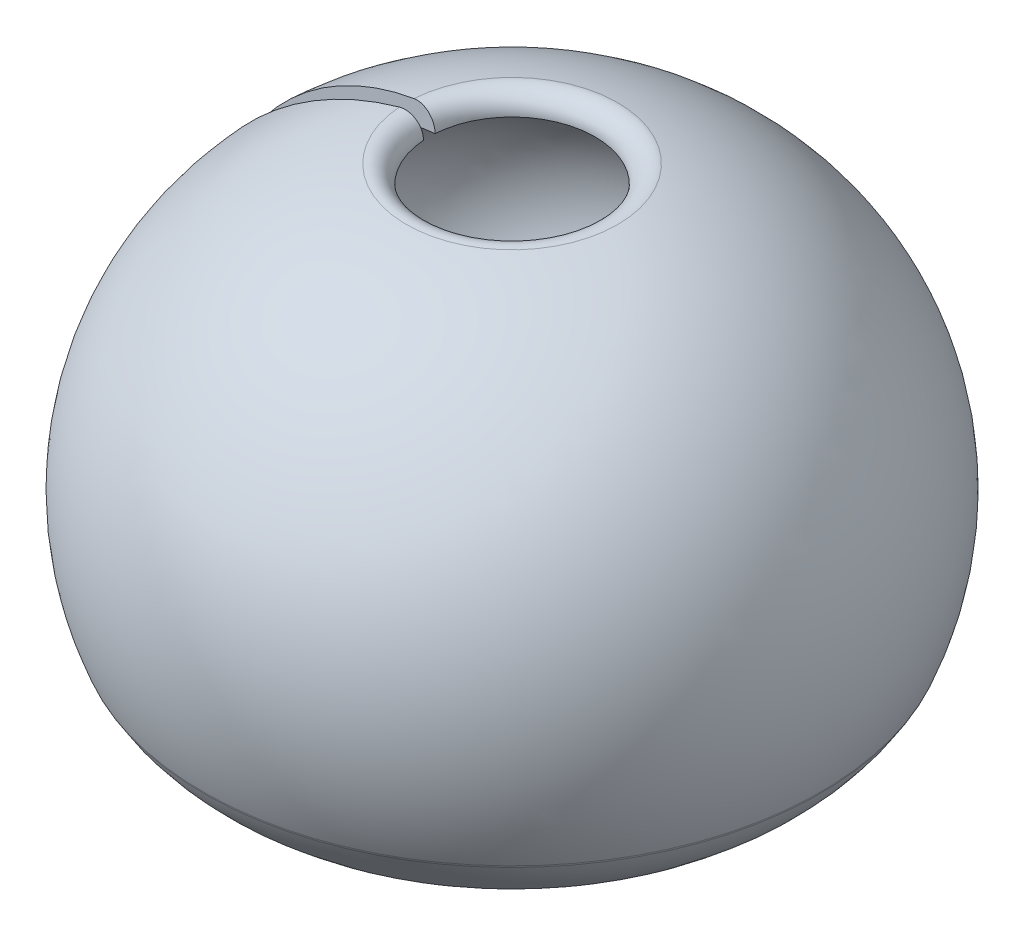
from build123d import *
from build123d.topology import SkipClean

# Parameters (mm, degrees)
ROTATION1_ANGLE           = 176
ROTATION1_OTHER_WAY_ANGLE = 176


with BuildPart() as part:
    # Arbeitsraum_Konstruktionsskizze → Rotation1 (revolve)
    with BuildSketch(Plane.XY):
        with BuildLine():
            ThreePointArc((952.606944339, 50.30015639), (917.01300015, 796.90907714), (326.170705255, 1254.726936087))
            ThreePointArc((326.170705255, 1254.726936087), (277.465264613, 1243.496190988), (256.337267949, 1198.197655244))
            ThreePointArc((256.337267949, 1198.197655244), (310.636045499, 1187.548810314), (364.097392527, 1173.278578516))
            ThreePointArc((364.097392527, 1173.278578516), (355.674166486, 1161.036815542), (344.373011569, 1151.388220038))
            ThreePointArc((344.373011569, 1151.388220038), (565.582105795, 797.527816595), (356.993293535, 436.084382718))
            ThreePointArc((356.993293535, 436.084382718), (314.529988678, 241.805588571), (139.221524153, 147.920955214))
            ThreePointArc((139.221524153, 147.920955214), (83.650795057, 125.88965359), (78.314281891, 66.349702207))
            ThreePointArc((78.314281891, 66.349702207), (507.013433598, -206.715279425), (949.377562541, 43.607360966))
            ThreePointArc((949.377562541, 43.607360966), (951.10143832, 46.901075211), (952.606944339, 50.30015639))
        make_face()
    revolve(axis=Axis((0, 0, 0), (0, 1, 0)), revolution_arc=ROTATION1_ANGLE)

    # Arbeitsraum_Konstruktionsskizze → Rotation1 other way (revolve)
    with SkipClean():  # the faces are left unmerged after this step: merging them gives an invalid solid
        with BuildSketch(Plane.XY):
            with BuildLine():
                ThreePointArc((952.606944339, 50.30015639), (917.01300015, 796.90907714), (326.170705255, 1254.726936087))
                ThreePointArc((326.170705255, 1254.726936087), (277.465264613, 1243.496190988), (256.337267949, 1198.197655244))
                ThreePointArc((256.337267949, 1198.197655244), (310.636045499, 1187.548810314), (364.097392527, 1173.278578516))
                ThreePointArc((364.097392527, 1173.278578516), (355.674166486, 1161.036815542), (344.373011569, 1151.388220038))
                ThreePointArc((344.373011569, 1151.388220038), (565.582105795, 797.527816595), (356.993293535, 436.084382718))
                ThreePointArc((356.993293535, 436.084382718), (314.529988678, 241.805588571), (139.221524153, 147.920955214))
                ThreePointArc((139.221524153, 147.920955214), (83.650795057, 125.88965359), (78.314281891, 66.349702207))
                ThreePointArc((78.314281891, 66.349702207), (507.013433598, -206.715279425), (949.377562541, 43.607360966))
                ThreePointArc((949.377562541, 43.607360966), (951.10143832, 46.901075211), (952.606944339, 50.30015639))
            make_face()
        revolve(axis=Axis((0, 0, 0), (0, -1, 0)), revolution_arc=ROTATION1_OTHER_WAY_ANGLE)


solid = part.part
